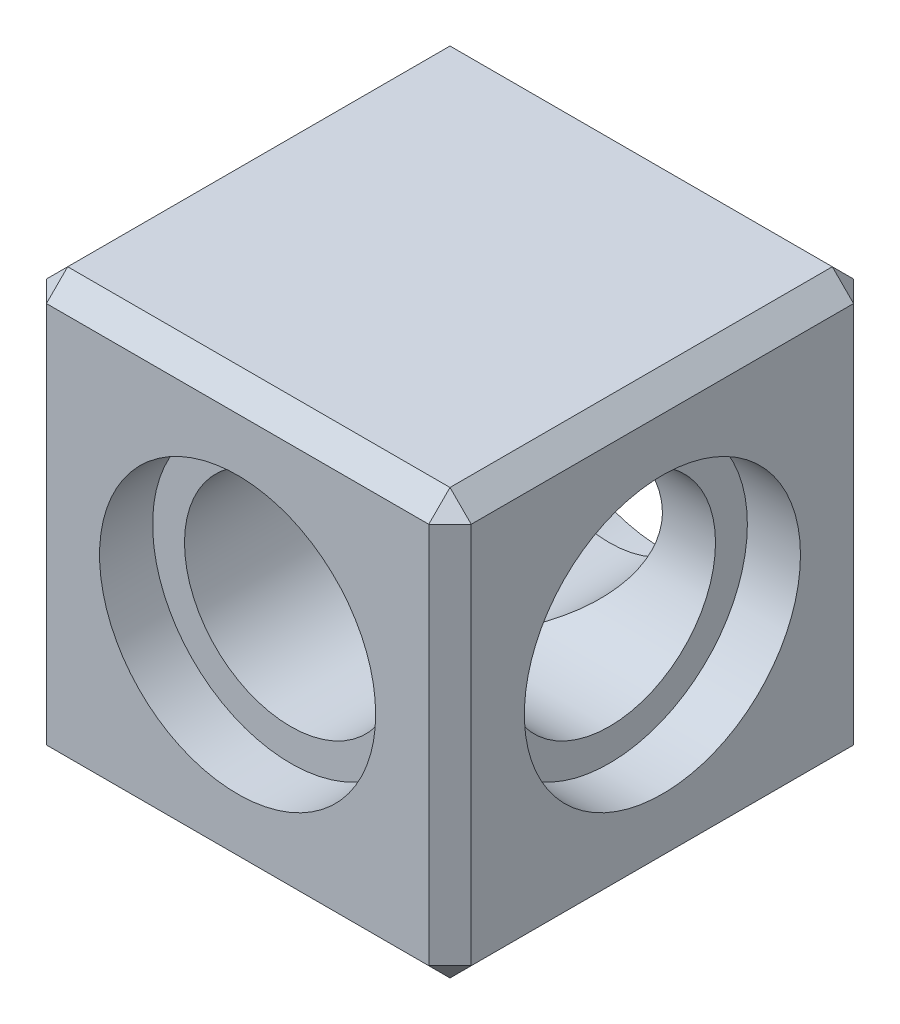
from build123d import *

# Parameters (mm, degrees)
SZKIC1_W                        = 40
SZKIC1_H                        = 40
DODANIE_WYCI_GNI_CIE1_DEPTH     = 20
SZKIC2_R                        = 10
WYTNIJ_WYCI_GNI_CIE1_DEPTH      = 49.989794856
WYTNIJ_WYCI_GNI_CIE2_REACH      = 50.99
WYTNIJ_WYCI_GNI_CIE2_END_RADIUS = 10
SZKIC3_R                        = 10
SZKIC4_R                        = 13
WYTNIJ_WYCI_GNI_CIE3_DEPTH      = 5
SZKIC5_R                        = 13
WYTNIJ_WYCI_GNI_CIE4_DEPTH      = 5
SFAZOWANIE1_SIZE                = 2


with BuildPart() as part:
    # Szkic1 → Dodanie-wyci_gni_cie1 (new, symmetric)
    with BuildSketch(Plane.XY):
        Rectangle(SZKIC1_W, SZKIC1_H)
    extrude(amount=DODANIE_WYCI_GNI_CIE1_DEPTH, both=True)

    # Szkic2 → Wytnij-wyci_gni_cie1 (cut, through all)
    with BuildSketch(Plane.XY.offset(20)):
        Circle(SZKIC2_R)
    extrude(amount=-WYTNIJ_WYCI_GNI_CIE1_DEPTH, mode=Mode.SUBTRACT)

    # Wytnij-wyci_gni_cie2: up to this cylinder (the profile starts outside it)
    wytnij_wyci_gni_cie2_end = Plane(origin=(0, 0, 0), z_dir=(0, 0, 1)) * Cylinder(WYTNIJ_WYCI_GNI_CIE2_END_RADIUS, 122.98, mode=Mode.PRIVATE)
    # Szkic3 → Wytnij-wyci_gni_cie2 (cut, up to the surface)
    with BuildSketch(Plane(origin=(20, 0, 0), x_dir=(0, 0, -1), z_dir=(1, 0, 0)), mode=Mode.PRIVATE) as wytnij_wyci_gni_cie2_sk1:
        Circle(SZKIC3_R)
    wytnij_wyci_gni_cie2_tool1 = extrude(wytnij_wyci_gni_cie2_sk1.sketch, amount=-WYTNIJ_WYCI_GNI_CIE2_REACH, mode=Mode.PRIVATE) - wytnij_wyci_gni_cie2_end
    add(wytnij_wyci_gni_cie2_tool1.solids().sort_by_distance((20, 0, 0))[0], mode=Mode.SUBTRACT)

    # Szkic4 → Wytnij-wyci_gni_cie3 (cut)
    with BuildSketch(Plane.XY.offset(20)):
        Circle(SZKIC4_R)
    wytnij_wyci_gni_cie3 = extrude(amount=-WYTNIJ_WYCI_GNI_CIE3_DEPTH, mode=Mode.SUBTRACT)

    # Lustro1: Wytnij-wyci_gni_cie3 across plane
    add(wytnij_wyci_gni_cie3.mirror(Plane.XY), mode=Mode.SUBTRACT)

    # Szkic5 → Wytnij-wyci_gni_cie4 (cut)
    with BuildSketch(Plane(origin=(20, 0, 0), x_dir=(0, 0, -1), z_dir=(1, 0, 0))):
        Circle(SZKIC5_R)
    extrude(amount=-WYTNIJ_WYCI_GNI_CIE4_DEPTH, mode=Mode.SUBTRACT)

    # Sfazowanie1
    sfazowanie1_edges = [part.edges().sort_by_distance(p)[0] for p in [
        (20, 0, 20),
        (0, 20, 20),
        (-20, 0, 20),
        (0, 20, -20),
        (20, 0, -20),
        (0, -20, -20),
        (-20, 0, -20),
        (0, -20, 20),
        (-20, 20, 0),
        (20, 20, 0),
        (20, -20, 0),
        (-20, -20, 0),
    ]]
    chamfer(sfazowanie1_edges, length=SFAZOWANIE1_SIZE)


solid = part.part
